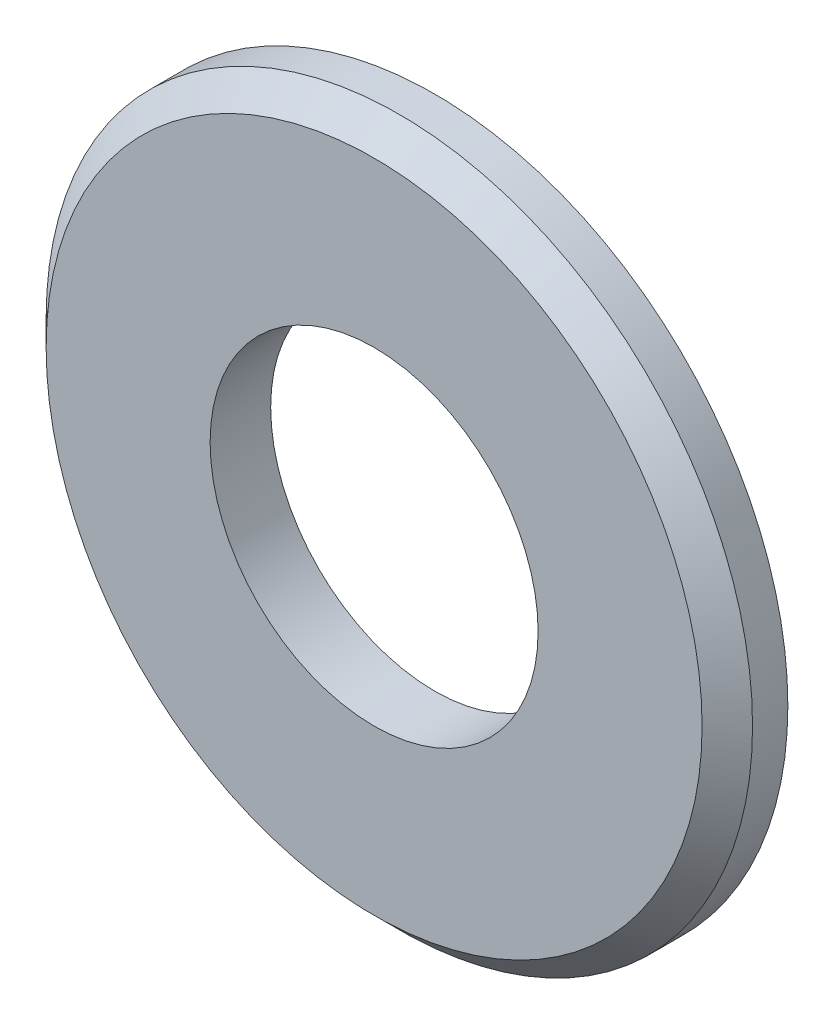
from build123d import *

# Parameters (mm, degrees)
ESQUISSE1_R          = 7
ESQUISSE1_R_2        = 3.25
BASE_EXTRUSION_DEPTH = 1.2
CHANFREIN1_SIZE      = 0.5


with BuildPart() as part:
    # Esquisse1 → Base-Extrusion (new body)
    with BuildSketch(Plane.XY):
        Circle(ESQUISSE1_R)
        Circle(ESQUISSE1_R_2, mode=Mode.SUBTRACT)
    extrude(amount=BASE_EXTRUSION_DEPTH)

    # Chanfrein1
    chanfrein1_edges = [part.edges().sort_by_distance(p)[0] for p in [
        (-7, 0, 1.2),
    ]]
    chamfer(chanfrein1_edges, length=CHANFREIN1_SIZE)


solid = part.part
